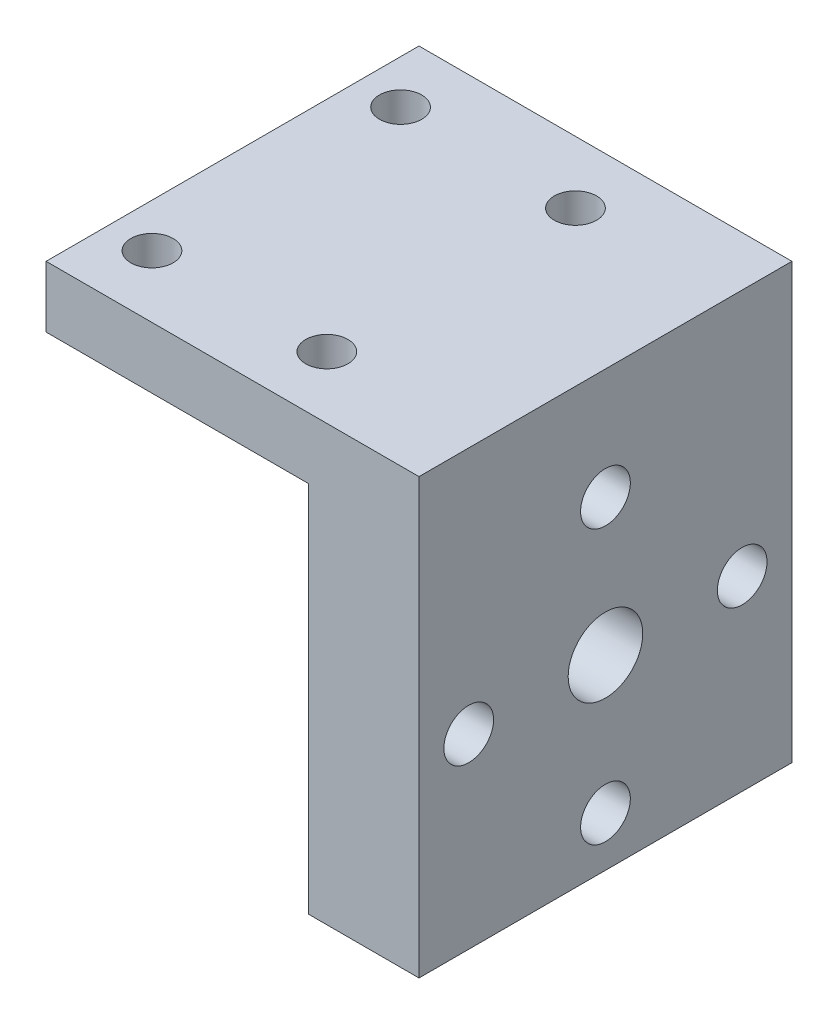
ISO-10303-21;
HEADER;
FILE_DESCRIPTION(('STEP AP214'),'2;1');
FILE_NAME('part.step','',(''),(''),'','','');
FILE_SCHEMA(('AUTOMOTIVE_DESIGN { 1 0 10303 214 1 1 1 1 }'));
ENDSEC;
DATA;
#1=APPLICATION_CONTEXT('core data for automotive mechanical design processes');
#2=APPLICATION_PROTOCOL_DEFINITION('international standard','automotive_design',2000,#1);
#3=PRODUCT_CONTEXT('',#1,'mechanical');
#4=PRODUCT('Part','Part','',(#3));
#5=PRODUCT_RELATED_PRODUCT_CATEGORY('part','',(#4));
#6=PRODUCT_DEFINITION_FORMATION('','',#4);
#7=PRODUCT_DEFINITION_CONTEXT('part definition',#1,'design');
#8=PRODUCT_DEFINITION('design','',#6,#7);
#9=PRODUCT_DEFINITION_SHAPE('','',#8);
#10=(LENGTH_UNIT() NAMED_UNIT(*) SI_UNIT(.MILLI.,.METRE.));
#11=(NAMED_UNIT(*) PLANE_ANGLE_UNIT() SI_UNIT($,.RADIAN.));
#12=(NAMED_UNIT(*) SI_UNIT($,.STERADIAN.) SOLID_ANGLE_UNIT());
#13=UNCERTAINTY_MEASURE_WITH_UNIT(LENGTH_MEASURE(1.E-05),#10,'distance_accuracy_value','');
#14=(GEOMETRIC_REPRESENTATION_CONTEXT(3) GLOBAL_UNCERTAINTY_ASSIGNED_CONTEXT((#13)) GLOBAL_UNIT_ASSIGNED_CONTEXT((#10,
#11,#12)) REPRESENTATION_CONTEXT('',''));
#15=CARTESIAN_POINT('',(0.,0.,0.));
#16=DIRECTION('',(0.,0.,1.));
#17=DIRECTION('',(1.,0.,0.));
#18=AXIS2_PLACEMENT_3D('',#15,#16,#17);
#19=CARTESIAN_POINT('',(0.,0.,30.));
#20=DIRECTION('',(1.,0.,0.));
#21=DIRECTION('',(0.,0.,-1.));
#22=AXIS2_PLACEMENT_3D('',#19,#20,#21);
#23=PLANE('',#22);
#24=CARTESIAN_POINT('',(0.,15.,4.));
#25=DIRECTION('',(-1.,0.,0.));
#26=DIRECTION('',(0.,0.,1.));
#27=AXIS2_PLACEMENT_3D('',#24,#25,#26);
#28=CIRCLE('',#27,2.);
#29=CARTESIAN_POINT('',(0.,15.,6.));
#30=VERTEX_POINT('',#29);
#31=EDGE_CURVE('E196',#30,#30,#28,.T.);
#32=ORIENTED_EDGE('',*,*,#31,.F.);
#33=EDGE_LOOP('',(#32));
#34=FACE_BOUND('',#33,.T.);
#35=CARTESIAN_POINT('',(0.,4.,15.));
#36=DIRECTION('',(-1.,0.,0.));
#37=DIRECTION('',(0.,0.,1.));
#38=AXIS2_PLACEMENT_3D('',#35,#36,#37);
#39=CIRCLE('',#38,2.);
#40=CARTESIAN_POINT('',(0.,4.,17.));
#41=VERTEX_POINT('',#40);
#42=EDGE_CURVE('E200',#41,#41,#39,.T.);
#43=ORIENTED_EDGE('',*,*,#42,.F.);
#44=EDGE_LOOP('',(#43));
#45=FACE_BOUND('',#44,.T.);
#46=CARTESIAN_POINT('',(0.,15.,26.));
#47=DIRECTION('',(-1.,0.,0.));
#48=DIRECTION('',(0.,0.,1.));
#49=AXIS2_PLACEMENT_3D('',#46,#47,#48);
#50=CIRCLE('',#49,2.);
#51=CARTESIAN_POINT('',(0.,15.,28.));
#52=VERTEX_POINT('',#51);
#53=EDGE_CURVE('E204',#52,#52,#50,.T.);
#54=ORIENTED_EDGE('',*,*,#53,.F.);
#55=EDGE_LOOP('',(#54));
#56=FACE_BOUND('',#55,.T.);
#57=CARTESIAN_POINT('',(0.,26.,15.));
#58=DIRECTION('',(-1.,0.,0.));
#59=DIRECTION('',(0.,0.,1.));
#60=AXIS2_PLACEMENT_3D('',#57,#58,#59);
#61=CIRCLE('',#60,2.);
#62=CARTESIAN_POINT('',(0.,26.,17.));
#63=VERTEX_POINT('',#62);
#64=EDGE_CURVE('E208',#63,#63,#61,.T.);
#65=ORIENTED_EDGE('',*,*,#64,.F.);
#66=EDGE_LOOP('',(#65));
#67=FACE_BOUND('',#66,.T.);
#68=CARTESIAN_POINT('',(0.,15.,15.));
#69=DIRECTION('',(-1.,0.,0.));
#70=DIRECTION('',(0.,0.,1.));
#71=AXIS2_PLACEMENT_3D('',#68,#69,#70);
#72=CIRCLE('',#71,8.95);
#73=CARTESIAN_POINT('',(0.,15.,23.95));
#74=VERTEX_POINT('',#73);
#75=EDGE_CURVE('E211',#74,#74,#72,.T.);
#76=ORIENTED_EDGE('',*,*,#75,.F.);
#77=EDGE_LOOP('',(#76));
#78=FACE_BOUND('',#77,.T.);
#79=DIRECTION('',(0.,-1.,0.));
#80=VECTOR('',#79,1.);
#81=CARTESIAN_POINT('',(0.,0.,0.));
#82=LINE('',#81,#80);
#83=CARTESIAN_POINT('',(0.,30.,0.));
#84=VERTEX_POINT('',#83);
#85=CARTESIAN_POINT('',(0.,0.,0.));
#86=VERTEX_POINT('',#85);
#87=EDGE_CURVE('E135',#84,#86,#82,.T.);
#88=ORIENTED_EDGE('',*,*,#87,.T.);
#89=DIRECTION('',(0.,0.,-1.));
#90=VECTOR('',#89,1.);
#91=CARTESIAN_POINT('',(0.,0.,30.));
#92=LINE('',#91,#90);
#93=CARTESIAN_POINT('',(0.,0.,30.));
#94=VERTEX_POINT('',#93);
#95=EDGE_CURVE('E11',#94,#86,#92,.T.);
#96=ORIENTED_EDGE('',*,*,#95,.F.);
#97=DIRECTION('',(0.,-1.,0.));
#98=VECTOR('',#97,1.);
#99=CARTESIAN_POINT('',(0.,0.,30.));
#100=LINE('',#99,#98);
#101=CARTESIAN_POINT('',(0.,30.,30.));
#102=VERTEX_POINT('',#101);
#103=EDGE_CURVE('E153',#102,#94,#100,.T.);
#104=ORIENTED_EDGE('',*,*,#103,.F.);
#105=DIRECTION('',(0.,0.,-1.));
#106=VECTOR('',#105,1.);
#107=CARTESIAN_POINT('',(0.,30.,30.));
#108=LINE('',#107,#106);
#109=EDGE_CURVE('E131',#102,#84,#108,.T.);
#110=ORIENTED_EDGE('',*,*,#109,.T.);
#111=EDGE_LOOP('',(#88,#96,#104,#110));
#112=FACE_BOUND('',#111,.T.);
#113=ADVANCED_FACE('F45',(#34,#45,#56,#67,#78,#112),#23,.F.);
#114=CARTESIAN_POINT('',(0.,0.,30.));
#115=DIRECTION('',(0.,1.,0.));
#116=DIRECTION('',(0.,0.,1.));
#117=AXIS2_PLACEMENT_3D('',#114,#115,#116);
#118=PLANE('',#117);
#119=DIRECTION('',(1.,0.,0.));
#120=VECTOR('',#119,1.);
#121=CARTESIAN_POINT('',(0.,0.,0.));
#122=LINE('',#121,#120);
#123=CARTESIAN_POINT('',(8.89688665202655,0.,0.));
#124=VERTEX_POINT('',#123);
#125=EDGE_CURVE('E139',#86,#124,#122,.T.);
#126=ORIENTED_EDGE('',*,*,#125,.T.);
#127=DIRECTION('',(0.,0.,-1.));
#128=VECTOR('',#127,1.);
#129=CARTESIAN_POINT('',(8.89688665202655,0.,30.));
#130=LINE('',#129,#128);
#131=CARTESIAN_POINT('',(8.89688665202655,0.,30.));
#132=VERTEX_POINT('',#131);
#133=EDGE_CURVE('E55',#132,#124,#130,.T.);
#134=ORIENTED_EDGE('',*,*,#133,.F.);
#135=DIRECTION('',(1.,0.,0.));
#136=VECTOR('',#135,1.);
#137=CARTESIAN_POINT('',(0.,0.,30.));
#138=LINE('',#137,#136);
#139=EDGE_CURVE('E100',#94,#132,#138,.T.);
#140=ORIENTED_EDGE('',*,*,#139,.F.);
#141=ORIENTED_EDGE('',*,*,#95,.T.);
#142=EDGE_LOOP('',(#126,#134,#140,#141));
#143=FACE_BOUND('',#142,.T.);
#144=ADVANCED_FACE('F164',(#143),#118,.F.);
#145=CARTESIAN_POINT('',(8.89688665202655,30.,30.));
#146=DIRECTION('',(-1.,0.,0.));
#147=DIRECTION('',(0.,0.,1.));
#148=AXIS2_PLACEMENT_3D('',#145,#146,#147);
#149=PLANE('',#148);
#150=CARTESIAN_POINT('',(8.89688665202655,15.,4.));
#151=DIRECTION('',(-1.,0.,0.));
#152=DIRECTION('',(0.,0.,1.));
#153=AXIS2_PLACEMENT_3D('',#150,#151,#152);
#154=CIRCLE('',#153,2.);
#155=CARTESIAN_POINT('',(8.89688665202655,15.,6.));
#156=VERTEX_POINT('',#155);
#157=EDGE_CURVE('E220',#156,#156,#154,.T.);
#158=ORIENTED_EDGE('',*,*,#157,.T.);
#159=EDGE_LOOP('',(#158));
#160=FACE_BOUND('',#159,.T.);
#161=CARTESIAN_POINT('',(8.89688665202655,4.,15.));
#162=DIRECTION('',(-1.,0.,0.));
#163=DIRECTION('',(0.,0.,1.));
#164=AXIS2_PLACEMENT_3D('',#161,#162,#163);
#165=CIRCLE('',#164,2.);
#166=CARTESIAN_POINT('',(8.89688665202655,4.,17.));
#167=VERTEX_POINT('',#166);
#168=EDGE_CURVE('E240',#167,#167,#165,.T.);
#169=ORIENTED_EDGE('',*,*,#168,.T.);
#170=EDGE_LOOP('',(#169));
#171=FACE_BOUND('',#170,.T.);
#172=CARTESIAN_POINT('',(8.89688665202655,15.,26.));
#173=DIRECTION('',(-1.,0.,0.));
#174=DIRECTION('',(0.,0.,1.));
#175=AXIS2_PLACEMENT_3D('',#172,#173,#174);
#176=CIRCLE('',#175,2.);
#177=CARTESIAN_POINT('',(8.89688665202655,15.,28.));
#178=VERTEX_POINT('',#177);
#179=EDGE_CURVE('E231',#178,#178,#176,.T.);
#180=ORIENTED_EDGE('',*,*,#179,.T.);
#181=EDGE_LOOP('',(#180));
#182=FACE_BOUND('',#181,.T.);
#183=CARTESIAN_POINT('',(8.89688665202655,15.,15.));
#184=DIRECTION('',(-1.,0.,0.));
#185=DIRECTION('',(0.,0.,1.));
#186=AXIS2_PLACEMENT_3D('',#183,#184,#185);
#187=CIRCLE('',#186,3.);
#188=CARTESIAN_POINT('',(8.89688665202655,15.,18.));
#189=VERTEX_POINT('',#188);
#190=EDGE_CURVE('E227',#189,#189,#187,.T.);
#191=ORIENTED_EDGE('',*,*,#190,.T.);
#192=EDGE_LOOP('',(#191));
#193=FACE_BOUND('',#192,.T.);
#194=CARTESIAN_POINT('',(8.89688665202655,26.,15.));
#195=DIRECTION('',(-1.,0.,0.));
#196=DIRECTION('',(0.,0.,1.));
#197=AXIS2_PLACEMENT_3D('',#194,#195,#196);
#198=CIRCLE('',#197,2.);
#199=CARTESIAN_POINT('',(8.89688665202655,26.,17.));
#200=VERTEX_POINT('',#199);
#201=EDGE_CURVE('E234',#200,#200,#198,.T.);
#202=ORIENTED_EDGE('',*,*,#201,.T.);
#203=EDGE_LOOP('',(#202));
#204=FACE_BOUND('',#203,.T.);
#205=DIRECTION('',(0.,1.,0.));
#206=VECTOR('',#205,1.);
#207=CARTESIAN_POINT('',(8.89688665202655,30.,0.));
#208=LINE('',#207,#206);
#209=CARTESIAN_POINT('',(8.89688665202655,34.9319696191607,0.));
#210=VERTEX_POINT('',#209);
#211=EDGE_CURVE('E144',#124,#210,#208,.T.);
#212=ORIENTED_EDGE('',*,*,#211,.T.);
#213=DIRECTION('',(0.,0.,-1.));
#214=VECTOR('',#213,1.);
#215=CARTESIAN_POINT('',(8.89688665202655,34.9319696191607,30.));
#216=LINE('',#215,#214);
#217=CARTESIAN_POINT('',(8.89688665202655,34.9319696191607,30.));
#218=VERTEX_POINT('',#217);
#219=EDGE_CURVE('E124',#218,#210,#216,.T.);
#220=ORIENTED_EDGE('',*,*,#219,.F.);
#221=DIRECTION('',(0.,1.,0.));
#222=VECTOR('',#221,1.);
#223=CARTESIAN_POINT('',(8.89688665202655,0.,30.));
#224=LINE('',#223,#222);
#225=EDGE_CURVE('E113',#132,#218,#224,.T.);
#226=ORIENTED_EDGE('',*,*,#225,.F.);
#227=ORIENTED_EDGE('',*,*,#133,.T.);
#228=EDGE_LOOP('',(#212,#220,#226,#227));
#229=FACE_BOUND('',#228,.T.);
#230=ADVANCED_FACE('F163',(#160,#171,#182,#193,#204,#229),#149,.F.);
#231=CARTESIAN_POINT('',(8.89688665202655,34.9319696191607,30.));
#232=DIRECTION('',(0.,-1.,0.));
#233=DIRECTION('',(0.,0.,-1.));
#234=AXIS2_PLACEMENT_3D('',#231,#232,#233);
#235=PLANE('',#234);
#236=CARTESIAN_POINT('',(-17.5859277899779,34.9319696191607,5.));
#237=DIRECTION('',(0.,-1.,0.));
#238=DIRECTION('',(0.,0.,-1.));
#239=AXIS2_PLACEMENT_3D('',#236,#237,#238);
#240=CIRCLE('',#239,1.7);
#241=CARTESIAN_POINT('',(-17.5859277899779,34.9319696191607,3.3));
#242=VERTEX_POINT('',#241);
#243=EDGE_CURVE('E263',#242,#242,#240,.T.);
#244=ORIENTED_EDGE('',*,*,#243,.T.);
#245=EDGE_LOOP('',(#244));
#246=FACE_BOUND('',#245,.T.);
#247=CARTESIAN_POINT('',(-3.51718555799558,34.9319696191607,5.));
#248=DIRECTION('',(0.,-1.,0.));
#249=DIRECTION('',(0.,0.,-1.));
#250=AXIS2_PLACEMENT_3D('',#247,#248,#249);
#251=CIRCLE('',#250,1.7);
#252=CARTESIAN_POINT('',(-3.51718555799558,34.9319696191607,3.3));
#253=VERTEX_POINT('',#252);
#254=EDGE_CURVE('E271',#253,#253,#251,.T.);
#255=ORIENTED_EDGE('',*,*,#254,.T.);
#256=EDGE_LOOP('',(#255));
#257=FACE_BOUND('',#256,.T.);
#258=CARTESIAN_POINT('',(-3.51718555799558,34.9319696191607,25.));
#259=DIRECTION('',(0.,-1.,0.));
#260=DIRECTION('',(0.,0.,-1.));
#261=AXIS2_PLACEMENT_3D('',#258,#259,#260);
#262=CIRCLE('',#261,1.7);
#263=CARTESIAN_POINT('',(-3.51718555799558,34.9319696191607,23.3));
#264=VERTEX_POINT('',#263);
#265=EDGE_CURVE('E279',#264,#264,#262,.T.);
#266=ORIENTED_EDGE('',*,*,#265,.T.);
#267=EDGE_LOOP('',(#266));
#268=FACE_BOUND('',#267,.T.);
#269=CARTESIAN_POINT('',(-17.5859277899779,34.9319696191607,25.));
#270=DIRECTION('',(0.,-1.,0.));
#271=DIRECTION('',(0.,0.,-1.));
#272=AXIS2_PLACEMENT_3D('',#269,#270,#271);
#273=CIRCLE('',#272,1.7);
#274=CARTESIAN_POINT('',(-17.5859277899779,34.9319696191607,23.3));
#275=VERTEX_POINT('',#274);
#276=EDGE_CURVE('E241',#275,#275,#273,.T.);
#277=ORIENTED_EDGE('',*,*,#276,.T.);
#278=EDGE_LOOP('',(#277));
#279=FACE_BOUND('',#278,.T.);
#280=DIRECTION('',(-1.,0.,0.));
#281=VECTOR('',#280,1.);
#282=CARTESIAN_POINT('',(8.89688665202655,34.9319696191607,0.));
#283=LINE('',#282,#281);
#284=CARTESIAN_POINT('',(-21.1031133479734,34.9319696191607,0.));
#285=VERTEX_POINT('',#284);
#286=EDGE_CURVE('E122',#210,#285,#283,.T.);
#287=ORIENTED_EDGE('',*,*,#286,.T.);
#288=DIRECTION('',(0.,0.,-1.));
#289=VECTOR('',#288,1.);
#290=CARTESIAN_POINT('',(-21.1031133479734,34.9319696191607,30.));
#291=LINE('',#290,#289);
#292=CARTESIAN_POINT('',(-21.1031133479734,34.9319696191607,30.));
#293=VERTEX_POINT('',#292);
#294=EDGE_CURVE('E119',#293,#285,#291,.T.);
#295=ORIENTED_EDGE('',*,*,#294,.F.);
#296=DIRECTION('',(-1.,0.,0.));
#297=VECTOR('',#296,1.);
#298=CARTESIAN_POINT('',(8.89688665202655,34.9319696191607,30.));
#299=LINE('',#298,#297);
#300=EDGE_CURVE('E107',#218,#293,#299,.T.);
#301=ORIENTED_EDGE('',*,*,#300,.F.);
#302=ORIENTED_EDGE('',*,*,#219,.T.);
#303=EDGE_LOOP('',(#287,#295,#301,#302));
#304=FACE_BOUND('',#303,.T.);
#305=ADVANCED_FACE('F120',(#246,#257,#268,#279,#304),#235,.F.);
#306=CARTESIAN_POINT('',(-21.1031133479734,30.,30.));
#307=DIRECTION('',(1.,0.,0.));
#308=DIRECTION('',(0.,0.,-1.));
#309=AXIS2_PLACEMENT_3D('',#306,#307,#308);
#310=PLANE('',#309);
#311=DIRECTION('',(0.,-1.,0.));
#312=VECTOR('',#311,1.);
#313=CARTESIAN_POINT('',(-21.1031133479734,30.,0.));
#314=LINE('',#313,#312);
#315=CARTESIAN_POINT('',(-21.1031133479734,30.,0.));
#316=VERTEX_POINT('',#315);
#317=EDGE_CURVE('E86',#285,#316,#314,.T.);
#318=ORIENTED_EDGE('',*,*,#317,.T.);
#319=DIRECTION('',(0.,0.,-1.));
#320=VECTOR('',#319,1.);
#321=CARTESIAN_POINT('',(-21.1031133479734,30.,30.));
#322=LINE('',#321,#320);
#323=CARTESIAN_POINT('',(-21.1031133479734,30.,30.));
#324=VERTEX_POINT('',#323);
#325=EDGE_CURVE('E125',#324,#316,#322,.T.);
#326=ORIENTED_EDGE('',*,*,#325,.F.);
#327=DIRECTION('',(0.,-1.,0.));
#328=VECTOR('',#327,1.);
#329=CARTESIAN_POINT('',(-21.1031133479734,30.,30.));
#330=LINE('',#329,#328);
#331=EDGE_CURVE('E111',#293,#324,#330,.T.);
#332=ORIENTED_EDGE('',*,*,#331,.F.);
#333=ORIENTED_EDGE('',*,*,#294,.T.);
#334=EDGE_LOOP('',(#318,#326,#332,#333));
#335=FACE_BOUND('',#334,.T.);
#336=ADVANCED_FACE('F127',(#335),#310,.F.);
#337=CARTESIAN_POINT('',(0.,30.,30.));
#338=DIRECTION('',(0.,1.,0.));
#339=DIRECTION('',(0.,0.,1.));
#340=AXIS2_PLACEMENT_3D('',#337,#338,#339);
#341=PLANE('',#340);
#342=CARTESIAN_POINT('',(-17.5859277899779,30.,5.));
#343=DIRECTION('',(0.,-1.,0.));
#344=DIRECTION('',(0.,0.,-1.));
#345=AXIS2_PLACEMENT_3D('',#342,#343,#344);
#346=CIRCLE('',#345,1.7);
#347=CARTESIAN_POINT('',(-17.5859277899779,30.,3.3));
#348=VERTEX_POINT('',#347);
#349=EDGE_CURVE('E267',#348,#348,#346,.T.);
#350=ORIENTED_EDGE('',*,*,#349,.F.);
#351=EDGE_LOOP('',(#350));
#352=FACE_BOUND('',#351,.T.);
#353=CARTESIAN_POINT('',(-3.51718555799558,30.,5.));
#354=DIRECTION('',(0.,-1.,0.));
#355=DIRECTION('',(0.,0.,-1.));
#356=AXIS2_PLACEMENT_3D('',#353,#354,#355);
#357=CIRCLE('',#356,1.7);
#358=CARTESIAN_POINT('',(-3.51718555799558,30.,3.3));
#359=VERTEX_POINT('',#358);
#360=EDGE_CURVE('E275',#359,#359,#357,.T.);
#361=ORIENTED_EDGE('',*,*,#360,.F.);
#362=EDGE_LOOP('',(#361));
#363=FACE_BOUND('',#362,.T.);
#364=CARTESIAN_POINT('',(-3.51718555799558,30.,25.));
#365=DIRECTION('',(0.,-1.,0.));
#366=DIRECTION('',(0.,0.,-1.));
#367=AXIS2_PLACEMENT_3D('',#364,#365,#366);
#368=CIRCLE('',#367,1.7);
#369=CARTESIAN_POINT('',(-3.51718555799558,30.,23.3));
#370=VERTEX_POINT('',#369);
#371=EDGE_CURVE('E259',#370,#370,#368,.T.);
#372=ORIENTED_EDGE('',*,*,#371,.F.);
#373=EDGE_LOOP('',(#372));
#374=FACE_BOUND('',#373,.T.);
#375=CARTESIAN_POINT('',(-17.5859277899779,30.,25.));
#376=DIRECTION('',(0.,-1.,0.));
#377=DIRECTION('',(0.,0.,-1.));
#378=AXIS2_PLACEMENT_3D('',#375,#376,#377);
#379=CIRCLE('',#378,1.7);
#380=CARTESIAN_POINT('',(-17.5859277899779,30.,23.3));
#381=VERTEX_POINT('',#380);
#382=EDGE_CURVE('E255',#381,#381,#379,.T.);
#383=ORIENTED_EDGE('',*,*,#382,.F.);
#384=EDGE_LOOP('',(#383));
#385=FACE_BOUND('',#384,.T.);
#386=DIRECTION('',(1.,0.,0.));
#387=VECTOR('',#386,1.);
#388=CARTESIAN_POINT('',(0.,30.,0.));
#389=LINE('',#388,#387);
#390=EDGE_CURVE('E92',#316,#84,#389,.T.);
#391=ORIENTED_EDGE('',*,*,#390,.T.);
#392=ORIENTED_EDGE('',*,*,#109,.F.);
#393=DIRECTION('',(1.,0.,0.));
#394=VECTOR('',#393,1.);
#395=CARTESIAN_POINT('',(0.,30.,30.));
#396=LINE('',#395,#394);
#397=EDGE_CURVE('E63',#324,#102,#396,.T.);
#398=ORIENTED_EDGE('',*,*,#397,.F.);
#399=ORIENTED_EDGE('',*,*,#325,.T.);
#400=EDGE_LOOP('',(#391,#392,#398,#399));
#401=FACE_BOUND('',#400,.T.);
#402=ADVANCED_FACE('F171',(#352,#363,#374,#385,#401),#341,.F.);
#403=CARTESIAN_POINT('',(0.,0.,30.));
#404=DIRECTION('',(0.,0.,1.));
#405=DIRECTION('',(1.,0.,0.));
#406=AXIS2_PLACEMENT_3D('',#403,#404,#405);
#407=PLANE('',#406);
#408=ORIENTED_EDGE('',*,*,#103,.T.);
#409=ORIENTED_EDGE('',*,*,#139,.T.);
#410=ORIENTED_EDGE('',*,*,#225,.T.);
#411=ORIENTED_EDGE('',*,*,#300,.T.);
#412=ORIENTED_EDGE('',*,*,#331,.T.);
#413=ORIENTED_EDGE('',*,*,#397,.T.);
#414=EDGE_LOOP('',(#408,#409,#410,#411,#412,#413));
#415=FACE_BOUND('',#414,.T.);
#416=ADVANCED_FACE('F109',(#415),#407,.T.);
#417=CARTESIAN_POINT('',(0.,0.,0.));
#418=DIRECTION('',(0.,0.,1.));
#419=DIRECTION('',(1.,0.,0.));
#420=AXIS2_PLACEMENT_3D('',#417,#418,#419);
#421=PLANE('',#420);
#422=ORIENTED_EDGE('',*,*,#87,.F.);
#423=ORIENTED_EDGE('',*,*,#390,.F.);
#424=ORIENTED_EDGE('',*,*,#317,.F.);
#425=ORIENTED_EDGE('',*,*,#286,.F.);
#426=ORIENTED_EDGE('',*,*,#211,.F.);
#427=ORIENTED_EDGE('',*,*,#125,.F.);
#428=EDGE_LOOP('',(#422,#423,#424,#425,#426,#427));
#429=FACE_BOUND('',#428,.T.);
#430=ADVANCED_FACE('F168',(#429),#421,.F.);
#431=CARTESIAN_POINT('',(2.,15.,15.));
#432=DIRECTION('',(-1.,0.,0.));
#433=DIRECTION('',(0.,0.,1.));
#434=AXIS2_PLACEMENT_3D('',#431,#432,#433);
#435=CYLINDRICAL_SURFACE('',#434,8.95);
#436=CARTESIAN_POINT('',(2.,15.,15.));
#437=DIRECTION('',(-1.,0.,0.));
#438=DIRECTION('',(0.,0.,1.));
#439=AXIS2_PLACEMENT_3D('',#436,#437,#438);
#440=CIRCLE('',#439,8.95);
#441=CARTESIAN_POINT('',(2.,15.,23.95));
#442=VERTEX_POINT('',#441);
#443=EDGE_CURVE('E140',#442,#442,#440,.T.);
#444=ORIENTED_EDGE('',*,*,#443,.F.);
#445=EDGE_LOOP('',(#444));
#446=FACE_BOUND('',#445,.T.);
#447=ORIENTED_EDGE('',*,*,#75,.T.);
#448=EDGE_LOOP('',(#447));
#449=FACE_BOUND('',#448,.T.);
#450=ADVANCED_FACE('F329',(#446,#449),#435,.F.);
#451=CARTESIAN_POINT('',(2.,15.,15.));
#452=DIRECTION('',(-1.,0.,0.));
#453=DIRECTION('',(0.,0.,1.));
#454=AXIS2_PLACEMENT_3D('',#451,#452,#453);
#455=PLANE('',#454);
#456=CARTESIAN_POINT('',(2.,15.,15.));
#457=DIRECTION('',(-1.,0.,0.));
#458=DIRECTION('',(0.,0.,1.));
#459=AXIS2_PLACEMENT_3D('',#456,#457,#458);
#460=CIRCLE('',#459,3.);
#461=CARTESIAN_POINT('',(2.,15.,18.));
#462=VERTEX_POINT('',#461);
#463=EDGE_CURVE('E48',#462,#462,#460,.T.);
#464=ORIENTED_EDGE('',*,*,#463,.F.);
#465=EDGE_LOOP('',(#464));
#466=FACE_BOUND('',#465,.T.);
#467=ORIENTED_EDGE('',*,*,#443,.T.);
#468=EDGE_LOOP('',(#467));
#469=FACE_BOUND('',#468,.T.);
#470=ADVANCED_FACE('F325',(#466,#469),#455,.T.);
#471=CARTESIAN_POINT('',(8.89688665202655,15.,15.));
#472=DIRECTION('',(-1.,0.,0.));
#473=DIRECTION('',(0.,0.,1.));
#474=AXIS2_PLACEMENT_3D('',#471,#472,#473);
#475=CYLINDRICAL_SURFACE('',#474,3.);
#476=ORIENTED_EDGE('',*,*,#463,.T.);
#477=EDGE_LOOP('',(#476));
#478=FACE_BOUND('',#477,.T.);
#479=ORIENTED_EDGE('',*,*,#190,.F.);
#480=EDGE_LOOP('',(#479));
#481=FACE_BOUND('',#480,.T.);
#482=ADVANCED_FACE('F321',(#478,#481),#475,.F.);
#483=CARTESIAN_POINT('',(8.89688665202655,26.,15.));
#484=DIRECTION('',(-1.,0.,0.));
#485=DIRECTION('',(0.,0.,1.));
#486=AXIS2_PLACEMENT_3D('',#483,#484,#485);
#487=CYLINDRICAL_SURFACE('',#486,2.);
#488=ORIENTED_EDGE('',*,*,#201,.F.);
#489=EDGE_LOOP('',(#488));
#490=FACE_BOUND('',#489,.T.);
#491=ORIENTED_EDGE('',*,*,#64,.T.);
#492=EDGE_LOOP('',(#491));
#493=FACE_BOUND('',#492,.T.);
#494=ADVANCED_FACE('F314',(#490,#493),#487,.F.);
#495=CARTESIAN_POINT('',(8.89688665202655,15.,26.));
#496=DIRECTION('',(-1.,0.,0.));
#497=DIRECTION('',(0.,0.,1.));
#498=AXIS2_PLACEMENT_3D('',#495,#496,#497);
#499=CYLINDRICAL_SURFACE('',#498,2.);
#500=ORIENTED_EDGE('',*,*,#179,.F.);
#501=EDGE_LOOP('',(#500));
#502=FACE_BOUND('',#501,.T.);
#503=ORIENTED_EDGE('',*,*,#53,.T.);
#504=EDGE_LOOP('',(#503));
#505=FACE_BOUND('',#504,.T.);
#506=ADVANCED_FACE('F311',(#502,#505),#499,.F.);
#507=CARTESIAN_POINT('',(8.89688665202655,4.,15.));
#508=DIRECTION('',(-1.,0.,0.));
#509=DIRECTION('',(0.,0.,1.));
#510=AXIS2_PLACEMENT_3D('',#507,#508,#509);
#511=CYLINDRICAL_SURFACE('',#510,2.);
#512=ORIENTED_EDGE('',*,*,#168,.F.);
#513=EDGE_LOOP('',(#512));
#514=FACE_BOUND('',#513,.T.);
#515=ORIENTED_EDGE('',*,*,#42,.T.);
#516=EDGE_LOOP('',(#515));
#517=FACE_BOUND('',#516,.T.);
#518=ADVANCED_FACE('F303',(#514,#517),#511,.F.);
#519=CARTESIAN_POINT('',(8.89688665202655,15.,4.));
#520=DIRECTION('',(-1.,0.,0.));
#521=DIRECTION('',(0.,0.,1.));
#522=AXIS2_PLACEMENT_3D('',#519,#520,#521);
#523=CYLINDRICAL_SURFACE('',#522,2.);
#524=ORIENTED_EDGE('',*,*,#157,.F.);
#525=EDGE_LOOP('',(#524));
#526=FACE_BOUND('',#525,.T.);
#527=ORIENTED_EDGE('',*,*,#31,.T.);
#528=EDGE_LOOP('',(#527));
#529=FACE_BOUND('',#528,.T.);
#530=ADVANCED_FACE('F293',(#526,#529),#523,.F.);
#531=CARTESIAN_POINT('',(-17.5859277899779,34.9319696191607,25.));
#532=DIRECTION('',(0.,-1.,0.));
#533=DIRECTION('',(0.,0.,-1.));
#534=AXIS2_PLACEMENT_3D('',#531,#532,#533);
#535=CYLINDRICAL_SURFACE('',#534,1.7);
#536=CARTESIAN_POINT('',(-17.5859277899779,34.9319696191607,23.3));
#537=CARTESIAN_POINT('',(-17.5859277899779,34.8805949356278,23.3));
#538=CARTESIAN_POINT('',(-17.5859277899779,34.8292202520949,23.3));
#539=CARTESIAN_POINT('',(-17.5859277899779,34.726470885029,23.3));
#540=CARTESIAN_POINT('',(-17.5859277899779,34.6750962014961,23.3));
#541=CARTESIAN_POINT('',(-17.5859277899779,34.5723468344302,23.3));
#542=CARTESIAN_POINT('',(-17.5859277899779,34.5209721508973,23.3));
#543=CARTESIAN_POINT('',(-17.5859277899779,34.4182227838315,23.3));
#544=CARTESIAN_POINT('',(-17.5859277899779,34.3668481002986,23.3));
#545=CARTESIAN_POINT('',(-17.5859277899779,34.2640987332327,23.3));
#546=CARTESIAN_POINT('',(-17.5859277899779,34.2127240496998,23.3));
#547=CARTESIAN_POINT('',(-17.5859277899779,34.1099746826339,23.3));
#548=CARTESIAN_POINT('',(-17.5859277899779,34.058599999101,23.3));
#549=CARTESIAN_POINT('',(-17.5859277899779,33.9558506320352,23.3));
#550=CARTESIAN_POINT('',(-17.5859277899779,33.9044759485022,23.3));
#551=CARTESIAN_POINT('',(-17.5859277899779,33.8017265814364,23.3));
#552=CARTESIAN_POINT('',(-17.5859277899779,33.7503518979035,23.3));
#553=CARTESIAN_POINT('',(-17.5859277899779,33.6476025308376,23.3));
#554=CARTESIAN_POINT('',(-17.5859277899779,33.5962278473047,23.3));
#555=CARTESIAN_POINT('',(-17.5859277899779,33.4934784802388,23.3));
#556=CARTESIAN_POINT('',(-17.5859277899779,33.4421037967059,23.3));
#557=CARTESIAN_POINT('',(-17.5859277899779,33.3393544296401,23.3));
#558=CARTESIAN_POINT('',(-17.5859277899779,33.2879797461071,23.3));
#559=CARTESIAN_POINT('',(-17.5859277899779,33.1852303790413,23.3));
#560=CARTESIAN_POINT('',(-17.5859277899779,33.1338556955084,23.3));
#561=CARTESIAN_POINT('',(-17.5859277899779,33.0311063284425,23.3));
#562=CARTESIAN_POINT('',(-17.5859277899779,32.9797316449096,23.3));
#563=CARTESIAN_POINT('',(-17.5859277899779,32.8769822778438,23.3));
#564=CARTESIAN_POINT('',(-17.5859277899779,32.8256075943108,23.3));
#565=CARTESIAN_POINT('',(-17.5859277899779,32.722858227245,23.3));
#566=CARTESIAN_POINT('',(-17.5859277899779,32.6714835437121,23.3));
#567=CARTESIAN_POINT('',(-17.5859277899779,32.5687341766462,23.3));
#568=CARTESIAN_POINT('',(-17.5859277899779,32.5173594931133,23.3));
#569=CARTESIAN_POINT('',(-17.5859277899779,32.4146101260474,23.3));
#570=CARTESIAN_POINT('',(-17.5859277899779,32.3632354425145,23.3));
#571=CARTESIAN_POINT('',(-17.5859277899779,32.2604860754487,23.3));
#572=CARTESIAN_POINT('',(-17.5859277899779,32.2091113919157,23.3));
#573=CARTESIAN_POINT('',(-17.5859277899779,32.1063620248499,23.3));
#574=CARTESIAN_POINT('',(-17.5859277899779,32.054987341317,23.3));
#575=CARTESIAN_POINT('',(-17.5859277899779,31.9522379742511,23.3));
#576=CARTESIAN_POINT('',(-17.5859277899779,31.9008632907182,23.3));
#577=CARTESIAN_POINT('',(-17.5859277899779,31.7981139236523,23.3));
#578=CARTESIAN_POINT('',(-17.5859277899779,31.7467392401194,23.3));
#579=CARTESIAN_POINT('',(-17.5859277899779,31.6439898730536,23.3));
#580=CARTESIAN_POINT('',(-17.5859277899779,31.5926151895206,23.3));
#581=CARTESIAN_POINT('',(-17.5859277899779,31.4898658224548,23.3));
#582=CARTESIAN_POINT('',(-17.5859277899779,31.4384911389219,23.3));
#583=CARTESIAN_POINT('',(-17.5859277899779,31.335741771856,23.3));
#584=CARTESIAN_POINT('',(-17.5859277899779,31.2843670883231,23.3));
#585=CARTESIAN_POINT('',(-17.5859277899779,31.1816177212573,23.3));
#586=CARTESIAN_POINT('',(-17.5859277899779,31.1302430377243,23.3));
#587=CARTESIAN_POINT('',(-17.5859277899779,31.0274936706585,23.3));
#588=CARTESIAN_POINT('',(-17.5859277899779,30.9761189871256,23.3));
#589=CARTESIAN_POINT('',(-17.5859277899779,30.8733696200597,23.3));
#590=CARTESIAN_POINT('',(-17.5859277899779,30.8219949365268,23.3));
#591=CARTESIAN_POINT('',(-17.5859277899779,30.7192455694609,23.3));
#592=CARTESIAN_POINT('',(-17.5859277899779,30.667870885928,23.3));
#593=CARTESIAN_POINT('',(-17.5859277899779,30.5651215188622,23.3));
#594=CARTESIAN_POINT('',(-17.5859277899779,30.5137468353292,23.3));
#595=CARTESIAN_POINT('',(-17.5859277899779,30.4109974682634,23.3));
#596=CARTESIAN_POINT('',(-17.5859277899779,30.3596227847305,23.3));
#597=CARTESIAN_POINT('',(-17.5859277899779,30.2568734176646,23.3));
#598=CARTESIAN_POINT('',(-17.5859277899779,30.2054987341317,23.3));
#599=CARTESIAN_POINT('',(-17.5859277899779,30.1027493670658,23.3));
#600=CARTESIAN_POINT('',(-17.5859277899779,30.0513746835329,23.3));
#601=CARTESIAN_POINT('',(-17.5859277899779,30.,23.3));
#602=B_SPLINE_CURVE_WITH_KNOTS('',3,(#536,#537,#538,#539,#540,#541,#542,#543,#544,#545,#546,
#547,#548,#549,#550,#551,#552,#553,#554,#555,#556,#557,#558,#559,#560,#561,#562,#563,#564,#565,
#566,#567,#568,#569,#570,#571,#572,#573,#574,#575,#576,#577,#578,#579,#580,#581,#582,#583,#584,
#585,#586,#587,#588,#589,#590,#591,#592,#593,#594,#595,#596,#597,#598,#599,#600,#601),
.UNSPECIFIED.,.F.,.F.,(4,2,2,2,2,2,2,2,2,2,2,2,2,2,2,2,2,2,2,2,2,2,2,2,2,2,2,2,2,2,2,2,4),(0.,
0.154124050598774,0.308248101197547,0.462372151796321,0.616496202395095,0.770620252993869,
0.924744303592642,1.07886835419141,1.23299240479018,1.38711645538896,1.54124050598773,
1.6953645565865,1.84948860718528,2.00361265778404,2.15773670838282,2.31186075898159,
2.46598480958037,2.62010886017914,2.77423291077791,2.92835696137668,3.08248101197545,
3.23660506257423,3.390729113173,3.54485316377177,3.69897721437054,3.85310126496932,
4.00722531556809,4.16134936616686,4.31547341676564,4.46959746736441,4.62372151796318,
4.77784556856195,4.93196961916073),.UNSPECIFIED.);
#603=EDGE_CURVE('BSEAM292',#275,#381,#602,.T.);
#604=ORIENTED_EDGE('',*,*,#276,.F.);
#605=ORIENTED_EDGE('',*,*,#382,.T.);
#606=ORIENTED_EDGE('',*,*,#603,.T.);
#607=ORIENTED_EDGE('',*,*,#603,.F.);
#608=EDGE_LOOP('',(#604,#606,#605,#607));
#609=FACE_BOUND('',#608,.T.);
#610=ADVANCED_FACE('F292',(#609),#535,.F.);
#611=CARTESIAN_POINT('',(-3.51718555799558,34.9319696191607,25.));
#612=DIRECTION('',(0.,-1.,0.));
#613=DIRECTION('',(0.,0.,-1.));
#614=AXIS2_PLACEMENT_3D('',#611,#612,#613);
#615=CYLINDRICAL_SURFACE('',#614,1.7);
#616=CARTESIAN_POINT('',(-3.51718555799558,34.9319696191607,23.3));
#617=CARTESIAN_POINT('',(-3.51718555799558,34.8805949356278,23.3));
#618=CARTESIAN_POINT('',(-3.51718555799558,34.8292202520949,23.3));
#619=CARTESIAN_POINT('',(-3.51718555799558,34.726470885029,23.3));
#620=CARTESIAN_POINT('',(-3.51718555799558,34.6750962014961,23.3));
#621=CARTESIAN_POINT('',(-3.51718555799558,34.5723468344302,23.3));
#622=CARTESIAN_POINT('',(-3.51718555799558,34.5209721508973,23.3));
#623=CARTESIAN_POINT('',(-3.51718555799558,34.4182227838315,23.3));
#624=CARTESIAN_POINT('',(-3.51718555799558,34.3668481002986,23.3));
#625=CARTESIAN_POINT('',(-3.51718555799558,34.2640987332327,23.3));
#626=CARTESIAN_POINT('',(-3.51718555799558,34.2127240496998,23.3));
#627=CARTESIAN_POINT('',(-3.51718555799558,34.1099746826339,23.3));
#628=CARTESIAN_POINT('',(-3.51718555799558,34.058599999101,23.3));
#629=CARTESIAN_POINT('',(-3.51718555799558,33.9558506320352,23.3));
#630=CARTESIAN_POINT('',(-3.51718555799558,33.9044759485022,23.3));
#631=CARTESIAN_POINT('',(-3.51718555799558,33.8017265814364,23.3));
#632=CARTESIAN_POINT('',(-3.51718555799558,33.7503518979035,23.3));
#633=CARTESIAN_POINT('',(-3.51718555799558,33.6476025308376,23.3));
#634=CARTESIAN_POINT('',(-3.51718555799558,33.5962278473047,23.3));
#635=CARTESIAN_POINT('',(-3.51718555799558,33.4934784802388,23.3));
#636=CARTESIAN_POINT('',(-3.51718555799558,33.4421037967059,23.3));
#637=CARTESIAN_POINT('',(-3.51718555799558,33.3393544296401,23.3));
#638=CARTESIAN_POINT('',(-3.51718555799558,33.2879797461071,23.3));
#639=CARTESIAN_POINT('',(-3.51718555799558,33.1852303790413,23.3));
#640=CARTESIAN_POINT('',(-3.51718555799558,33.1338556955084,23.3));
#641=CARTESIAN_POINT('',(-3.51718555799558,33.0311063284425,23.3));
#642=CARTESIAN_POINT('',(-3.51718555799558,32.9797316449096,23.3));
#643=CARTESIAN_POINT('',(-3.51718555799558,32.8769822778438,23.3));
#644=CARTESIAN_POINT('',(-3.51718555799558,32.8256075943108,23.3));
#645=CARTESIAN_POINT('',(-3.51718555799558,32.722858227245,23.3));
#646=CARTESIAN_POINT('',(-3.51718555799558,32.6714835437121,23.3));
#647=CARTESIAN_POINT('',(-3.51718555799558,32.5687341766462,23.3));
#648=CARTESIAN_POINT('',(-3.51718555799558,32.5173594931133,23.3));
#649=CARTESIAN_POINT('',(-3.51718555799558,32.4146101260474,23.3));
#650=CARTESIAN_POINT('',(-3.51718555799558,32.3632354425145,23.3));
#651=CARTESIAN_POINT('',(-3.51718555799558,32.2604860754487,23.3));
#652=CARTESIAN_POINT('',(-3.51718555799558,32.2091113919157,23.3));
#653=CARTESIAN_POINT('',(-3.51718555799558,32.1063620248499,23.3));
#654=CARTESIAN_POINT('',(-3.51718555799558,32.054987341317,23.3));
#655=CARTESIAN_POINT('',(-3.51718555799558,31.9522379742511,23.3));
#656=CARTESIAN_POINT('',(-3.51718555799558,31.9008632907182,23.3));
#657=CARTESIAN_POINT('',(-3.51718555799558,31.7981139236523,23.3));
#658=CARTESIAN_POINT('',(-3.51718555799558,31.7467392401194,23.3));
#659=CARTESIAN_POINT('',(-3.51718555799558,31.6439898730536,23.3));
#660=CARTESIAN_POINT('',(-3.51718555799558,31.5926151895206,23.3));
#661=CARTESIAN_POINT('',(-3.51718555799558,31.4898658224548,23.3));
#662=CARTESIAN_POINT('',(-3.51718555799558,31.4384911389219,23.3));
#663=CARTESIAN_POINT('',(-3.51718555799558,31.335741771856,23.3));
#664=CARTESIAN_POINT('',(-3.51718555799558,31.2843670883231,23.3));
#665=CARTESIAN_POINT('',(-3.51718555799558,31.1816177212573,23.3));
#666=CARTESIAN_POINT('',(-3.51718555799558,31.1302430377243,23.3));
#667=CARTESIAN_POINT('',(-3.51718555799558,31.0274936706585,23.3));
#668=CARTESIAN_POINT('',(-3.51718555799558,30.9761189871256,23.3));
#669=CARTESIAN_POINT('',(-3.51718555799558,30.8733696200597,23.3));
#670=CARTESIAN_POINT('',(-3.51718555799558,30.8219949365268,23.3));
#671=CARTESIAN_POINT('',(-3.51718555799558,30.7192455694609,23.3));
#672=CARTESIAN_POINT('',(-3.51718555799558,30.667870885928,23.3));
#673=CARTESIAN_POINT('',(-3.51718555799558,30.5651215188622,23.3));
#674=CARTESIAN_POINT('',(-3.51718555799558,30.5137468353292,23.3));
#675=CARTESIAN_POINT('',(-3.51718555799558,30.4109974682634,23.3));
#676=CARTESIAN_POINT('',(-3.51718555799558,30.3596227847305,23.3));
#677=CARTESIAN_POINT('',(-3.51718555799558,30.2568734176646,23.3));
#678=CARTESIAN_POINT('',(-3.51718555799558,30.2054987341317,23.3));
#679=CARTESIAN_POINT('',(-3.51718555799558,30.1027493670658,23.3));
#680=CARTESIAN_POINT('',(-3.51718555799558,30.0513746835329,23.3));
#681=CARTESIAN_POINT('',(-3.51718555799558,30.,23.3));
#682=B_SPLINE_CURVE_WITH_KNOTS('',3,(#616,#617,#618,#619,#620,#621,#622,#623,#624,#625,#626,
#627,#628,#629,#630,#631,#632,#633,#634,#635,#636,#637,#638,#639,#640,#641,#642,#643,#644,#645,
#646,#647,#648,#649,#650,#651,#652,#653,#654,#655,#656,#657,#658,#659,#660,#661,#662,#663,#664,
#665,#666,#667,#668,#669,#670,#671,#672,#673,#674,#675,#676,#677,#678,#679,#680,#681),
.UNSPECIFIED.,.F.,.F.,(4,2,2,2,2,2,2,2,2,2,2,2,2,2,2,2,2,2,2,2,2,2,2,2,2,2,2,2,2,2,2,2,4),(0.,
0.154124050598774,0.308248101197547,0.462372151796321,0.616496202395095,0.770620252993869,
0.924744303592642,1.07886835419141,1.23299240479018,1.38711645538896,1.54124050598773,
1.6953645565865,1.84948860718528,2.00361265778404,2.15773670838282,2.31186075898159,
2.46598480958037,2.62010886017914,2.77423291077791,2.92835696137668,3.08248101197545,
3.23660506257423,3.390729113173,3.54485316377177,3.69897721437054,3.85310126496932,
4.00722531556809,4.16134936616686,4.31547341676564,4.46959746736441,4.62372151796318,
4.77784556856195,4.93196961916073),.UNSPECIFIED.);
#683=EDGE_CURVE('BSEAM287',#264,#370,#682,.T.);
#684=ORIENTED_EDGE('',*,*,#265,.F.);
#685=ORIENTED_EDGE('',*,*,#371,.T.);
#686=ORIENTED_EDGE('',*,*,#683,.T.);
#687=ORIENTED_EDGE('',*,*,#683,.F.);
#688=EDGE_LOOP('',(#684,#686,#685,#687));
#689=FACE_BOUND('',#688,.T.);
#690=ADVANCED_FACE('F287',(#689),#615,.F.);
#691=CARTESIAN_POINT('',(-3.51718555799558,34.9319696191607,5.));
#692=DIRECTION('',(0.,-1.,0.));
#693=DIRECTION('',(0.,0.,-1.));
#694=AXIS2_PLACEMENT_3D('',#691,#692,#693);
#695=CYLINDRICAL_SURFACE('',#694,1.7);
#696=CARTESIAN_POINT('',(-3.51718555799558,34.9319696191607,3.3));
#697=CARTESIAN_POINT('',(-3.51718555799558,34.8805949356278,3.3));
#698=CARTESIAN_POINT('',(-3.51718555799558,34.8292202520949,3.3));
#699=CARTESIAN_POINT('',(-3.51718555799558,34.726470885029,3.3));
#700=CARTESIAN_POINT('',(-3.51718555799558,34.6750962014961,3.3));
#701=CARTESIAN_POINT('',(-3.51718555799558,34.5723468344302,3.3));
#702=CARTESIAN_POINT('',(-3.51718555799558,34.5209721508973,3.3));
#703=CARTESIAN_POINT('',(-3.51718555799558,34.4182227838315,3.3));
#704=CARTESIAN_POINT('',(-3.51718555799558,34.3668481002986,3.3));
#705=CARTESIAN_POINT('',(-3.51718555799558,34.2640987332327,3.3));
#706=CARTESIAN_POINT('',(-3.51718555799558,34.2127240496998,3.3));
#707=CARTESIAN_POINT('',(-3.51718555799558,34.1099746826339,3.3));
#708=CARTESIAN_POINT('',(-3.51718555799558,34.058599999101,3.3));
#709=CARTESIAN_POINT('',(-3.51718555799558,33.9558506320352,3.3));
#710=CARTESIAN_POINT('',(-3.51718555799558,33.9044759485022,3.3));
#711=CARTESIAN_POINT('',(-3.51718555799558,33.8017265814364,3.3));
#712=CARTESIAN_POINT('',(-3.51718555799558,33.7503518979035,3.3));
#713=CARTESIAN_POINT('',(-3.51718555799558,33.6476025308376,3.3));
#714=CARTESIAN_POINT('',(-3.51718555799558,33.5962278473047,3.3));
#715=CARTESIAN_POINT('',(-3.51718555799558,33.4934784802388,3.3));
#716=CARTESIAN_POINT('',(-3.51718555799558,33.4421037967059,3.3));
#717=CARTESIAN_POINT('',(-3.51718555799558,33.3393544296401,3.3));
#718=CARTESIAN_POINT('',(-3.51718555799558,33.2879797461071,3.3));
#719=CARTESIAN_POINT('',(-3.51718555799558,33.1852303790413,3.3));
#720=CARTESIAN_POINT('',(-3.51718555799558,33.1338556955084,3.3));
#721=CARTESIAN_POINT('',(-3.51718555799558,33.0311063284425,3.3));
#722=CARTESIAN_POINT('',(-3.51718555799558,32.9797316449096,3.3));
#723=CARTESIAN_POINT('',(-3.51718555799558,32.8769822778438,3.3));
#724=CARTESIAN_POINT('',(-3.51718555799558,32.8256075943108,3.3));
#725=CARTESIAN_POINT('',(-3.51718555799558,32.722858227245,3.3));
#726=CARTESIAN_POINT('',(-3.51718555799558,32.6714835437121,3.3));
#727=CARTESIAN_POINT('',(-3.51718555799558,32.5687341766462,3.3));
#728=CARTESIAN_POINT('',(-3.51718555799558,32.5173594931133,3.3));
#729=CARTESIAN_POINT('',(-3.51718555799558,32.4146101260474,3.3));
#730=CARTESIAN_POINT('',(-3.51718555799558,32.3632354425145,3.3));
#731=CARTESIAN_POINT('',(-3.51718555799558,32.2604860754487,3.3));
#732=CARTESIAN_POINT('',(-3.51718555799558,32.2091113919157,3.3));
#733=CARTESIAN_POINT('',(-3.51718555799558,32.1063620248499,3.3));
#734=CARTESIAN_POINT('',(-3.51718555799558,32.054987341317,3.3));
#735=CARTESIAN_POINT('',(-3.51718555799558,31.9522379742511,3.3));
#736=CARTESIAN_POINT('',(-3.51718555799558,31.9008632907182,3.3));
#737=CARTESIAN_POINT('',(-3.51718555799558,31.7981139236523,3.3));
#738=CARTESIAN_POINT('',(-3.51718555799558,31.7467392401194,3.3));
#739=CARTESIAN_POINT('',(-3.51718555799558,31.6439898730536,3.3));
#740=CARTESIAN_POINT('',(-3.51718555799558,31.5926151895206,3.3));
#741=CARTESIAN_POINT('',(-3.51718555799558,31.4898658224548,3.3));
#742=CARTESIAN_POINT('',(-3.51718555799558,31.4384911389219,3.3));
#743=CARTESIAN_POINT('',(-3.51718555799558,31.335741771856,3.3));
#744=CARTESIAN_POINT('',(-3.51718555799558,31.2843670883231,3.3));
#745=CARTESIAN_POINT('',(-3.51718555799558,31.1816177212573,3.3));
#746=CARTESIAN_POINT('',(-3.51718555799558,31.1302430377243,3.3));
#747=CARTESIAN_POINT('',(-3.51718555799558,31.0274936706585,3.3));
#748=CARTESIAN_POINT('',(-3.51718555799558,30.9761189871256,3.3));
#749=CARTESIAN_POINT('',(-3.51718555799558,30.8733696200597,3.3));
#750=CARTESIAN_POINT('',(-3.51718555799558,30.8219949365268,3.3));
#751=CARTESIAN_POINT('',(-3.51718555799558,30.7192455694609,3.3));
#752=CARTESIAN_POINT('',(-3.51718555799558,30.667870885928,3.3));
#753=CARTESIAN_POINT('',(-3.51718555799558,30.5651215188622,3.3));
#754=CARTESIAN_POINT('',(-3.51718555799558,30.5137468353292,3.3));
#755=CARTESIAN_POINT('',(-3.51718555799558,30.4109974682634,3.3));
#756=CARTESIAN_POINT('',(-3.51718555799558,30.3596227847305,3.3));
#757=CARTESIAN_POINT('',(-3.51718555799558,30.2568734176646,3.3));
#758=CARTESIAN_POINT('',(-3.51718555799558,30.2054987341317,3.3));
#759=CARTESIAN_POINT('',(-3.51718555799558,30.1027493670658,3.3));
#760=CARTESIAN_POINT('',(-3.51718555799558,30.0513746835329,3.3));
#761=CARTESIAN_POINT('',(-3.51718555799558,30.,3.3));
#762=B_SPLINE_CURVE_WITH_KNOTS('',3,(#696,#697,#698,#699,#700,#701,#702,#703,#704,#705,#706,
#707,#708,#709,#710,#711,#712,#713,#714,#715,#716,#717,#718,#719,#720,#721,#722,#723,#724,#725,
#726,#727,#728,#729,#730,#731,#732,#733,#734,#735,#736,#737,#738,#739,#740,#741,#742,#743,#744,
#745,#746,#747,#748,#749,#750,#751,#752,#753,#754,#755,#756,#757,#758,#759,#760,#761),
.UNSPECIFIED.,.F.,.F.,(4,2,2,2,2,2,2,2,2,2,2,2,2,2,2,2,2,2,2,2,2,2,2,2,2,2,2,2,2,2,2,2,4),(0.,
0.154124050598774,0.308248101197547,0.462372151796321,0.616496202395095,0.770620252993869,
0.924744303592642,1.07886835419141,1.23299240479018,1.38711645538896,1.54124050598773,
1.6953645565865,1.84948860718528,2.00361265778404,2.15773670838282,2.31186075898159,
2.46598480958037,2.62010886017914,2.77423291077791,2.92835696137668,3.08248101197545,
3.23660506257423,3.390729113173,3.54485316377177,3.69897721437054,3.85310126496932,
4.00722531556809,4.16134936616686,4.31547341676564,4.46959746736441,4.62372151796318,
4.77784556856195,4.93196961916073),.UNSPECIFIED.);
#763=EDGE_CURVE('BSEAM299',#253,#359,#762,.T.);
#764=ORIENTED_EDGE('',*,*,#254,.F.);
#765=ORIENTED_EDGE('',*,*,#360,.T.);
#766=ORIENTED_EDGE('',*,*,#763,.T.);
#767=ORIENTED_EDGE('',*,*,#763,.F.);
#768=EDGE_LOOP('',(#764,#766,#765,#767));
#769=FACE_BOUND('',#768,.T.);
#770=ADVANCED_FACE('F299',(#769),#695,.F.);
#771=CARTESIAN_POINT('',(-17.5859277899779,34.9319696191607,5.));
#772=DIRECTION('',(0.,-1.,0.));
#773=DIRECTION('',(0.,0.,-1.));
#774=AXIS2_PLACEMENT_3D('',#771,#772,#773);
#775=CYLINDRICAL_SURFACE('',#774,1.7);
#776=CARTESIAN_POINT('',(-17.5859277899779,34.9319696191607,3.3));
#777=CARTESIAN_POINT('',(-17.5859277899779,34.8805949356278,3.3));
#778=CARTESIAN_POINT('',(-17.5859277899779,34.8292202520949,3.3));
#779=CARTESIAN_POINT('',(-17.5859277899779,34.726470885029,3.3));
#780=CARTESIAN_POINT('',(-17.5859277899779,34.6750962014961,3.3));
#781=CARTESIAN_POINT('',(-17.5859277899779,34.5723468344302,3.3));
#782=CARTESIAN_POINT('',(-17.5859277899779,34.5209721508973,3.3));
#783=CARTESIAN_POINT('',(-17.5859277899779,34.4182227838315,3.3));
#784=CARTESIAN_POINT('',(-17.5859277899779,34.3668481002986,3.3));
#785=CARTESIAN_POINT('',(-17.5859277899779,34.2640987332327,3.3));
#786=CARTESIAN_POINT('',(-17.5859277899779,34.2127240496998,3.3));
#787=CARTESIAN_POINT('',(-17.5859277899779,34.1099746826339,3.3));
#788=CARTESIAN_POINT('',(-17.5859277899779,34.058599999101,3.3));
#789=CARTESIAN_POINT('',(-17.5859277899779,33.9558506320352,3.3));
#790=CARTESIAN_POINT('',(-17.5859277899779,33.9044759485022,3.3));
#791=CARTESIAN_POINT('',(-17.5859277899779,33.8017265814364,3.3));
#792=CARTESIAN_POINT('',(-17.5859277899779,33.7503518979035,3.3));
#793=CARTESIAN_POINT('',(-17.5859277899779,33.6476025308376,3.3));
#794=CARTESIAN_POINT('',(-17.5859277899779,33.5962278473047,3.3));
#795=CARTESIAN_POINT('',(-17.5859277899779,33.4934784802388,3.3));
#796=CARTESIAN_POINT('',(-17.5859277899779,33.4421037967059,3.3));
#797=CARTESIAN_POINT('',(-17.5859277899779,33.3393544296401,3.3));
#798=CARTESIAN_POINT('',(-17.5859277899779,33.2879797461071,3.3));
#799=CARTESIAN_POINT('',(-17.5859277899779,33.1852303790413,3.3));
#800=CARTESIAN_POINT('',(-17.5859277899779,33.1338556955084,3.3));
#801=CARTESIAN_POINT('',(-17.5859277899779,33.0311063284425,3.3));
#802=CARTESIAN_POINT('',(-17.5859277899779,32.9797316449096,3.3));
#803=CARTESIAN_POINT('',(-17.5859277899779,32.8769822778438,3.3));
#804=CARTESIAN_POINT('',(-17.5859277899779,32.8256075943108,3.3));
#805=CARTESIAN_POINT('',(-17.5859277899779,32.722858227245,3.3));
#806=CARTESIAN_POINT('',(-17.5859277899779,32.6714835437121,3.3));
#807=CARTESIAN_POINT('',(-17.5859277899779,32.5687341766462,3.3));
#808=CARTESIAN_POINT('',(-17.5859277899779,32.5173594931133,3.3));
#809=CARTESIAN_POINT('',(-17.5859277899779,32.4146101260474,3.3));
#810=CARTESIAN_POINT('',(-17.5859277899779,32.3632354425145,3.3));
#811=CARTESIAN_POINT('',(-17.5859277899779,32.2604860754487,3.3));
#812=CARTESIAN_POINT('',(-17.5859277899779,32.2091113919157,3.3));
#813=CARTESIAN_POINT('',(-17.5859277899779,32.1063620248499,3.3));
#814=CARTESIAN_POINT('',(-17.5859277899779,32.054987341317,3.3));
#815=CARTESIAN_POINT('',(-17.5859277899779,31.9522379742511,3.3));
#816=CARTESIAN_POINT('',(-17.5859277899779,31.9008632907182,3.3));
#817=CARTESIAN_POINT('',(-17.5859277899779,31.7981139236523,3.3));
#818=CARTESIAN_POINT('',(-17.5859277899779,31.7467392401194,3.3));
#819=CARTESIAN_POINT('',(-17.5859277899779,31.6439898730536,3.3));
#820=CARTESIAN_POINT('',(-17.5859277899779,31.5926151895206,3.3));
#821=CARTESIAN_POINT('',(-17.5859277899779,31.4898658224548,3.3));
#822=CARTESIAN_POINT('',(-17.5859277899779,31.4384911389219,3.3));
#823=CARTESIAN_POINT('',(-17.5859277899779,31.335741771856,3.3));
#824=CARTESIAN_POINT('',(-17.5859277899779,31.2843670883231,3.3));
#825=CARTESIAN_POINT('',(-17.5859277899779,31.1816177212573,3.3));
#826=CARTESIAN_POINT('',(-17.5859277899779,31.1302430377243,3.3));
#827=CARTESIAN_POINT('',(-17.5859277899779,31.0274936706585,3.3));
#828=CARTESIAN_POINT('',(-17.5859277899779,30.9761189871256,3.3));
#829=CARTESIAN_POINT('',(-17.5859277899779,30.8733696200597,3.3));
#830=CARTESIAN_POINT('',(-17.5859277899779,30.8219949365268,3.3));
#831=CARTESIAN_POINT('',(-17.5859277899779,30.7192455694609,3.3));
#832=CARTESIAN_POINT('',(-17.5859277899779,30.667870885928,3.3));
#833=CARTESIAN_POINT('',(-17.5859277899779,30.5651215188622,3.3));
#834=CARTESIAN_POINT('',(-17.5859277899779,30.5137468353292,3.3));
#835=CARTESIAN_POINT('',(-17.5859277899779,30.4109974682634,3.3));
#836=CARTESIAN_POINT('',(-17.5859277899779,30.3596227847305,3.3));
#837=CARTESIAN_POINT('',(-17.5859277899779,30.2568734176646,3.3));
#838=CARTESIAN_POINT('',(-17.5859277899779,30.2054987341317,3.3));
#839=CARTESIAN_POINT('',(-17.5859277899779,30.1027493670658,3.3));
#840=CARTESIAN_POINT('',(-17.5859277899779,30.0513746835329,3.3));
#841=CARTESIAN_POINT('',(-17.5859277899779,30.,3.3));
#842=B_SPLINE_CURVE_WITH_KNOTS('',3,(#776,#777,#778,#779,#780,#781,#782,#783,#784,#785,#786,
#787,#788,#789,#790,#791,#792,#793,#794,#795,#796,#797,#798,#799,#800,#801,#802,#803,#804,#805,
#806,#807,#808,#809,#810,#811,#812,#813,#814,#815,#816,#817,#818,#819,#820,#821,#822,#823,#824,
#825,#826,#827,#828,#829,#830,#831,#832,#833,#834,#835,#836,#837,#838,#839,#840,#841),
.UNSPECIFIED.,.F.,.F.,(4,2,2,2,2,2,2,2,2,2,2,2,2,2,2,2,2,2,2,2,2,2,2,2,2,2,2,2,2,2,2,2,4),(0.,
0.154124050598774,0.308248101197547,0.462372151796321,0.616496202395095,0.770620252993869,
0.924744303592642,1.07886835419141,1.23299240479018,1.38711645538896,1.54124050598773,
1.6953645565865,1.84948860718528,2.00361265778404,2.15773670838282,2.31186075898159,
2.46598480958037,2.62010886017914,2.77423291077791,2.92835696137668,3.08248101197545,
3.23660506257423,3.390729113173,3.54485316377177,3.69897721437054,3.85310126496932,
4.00722531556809,4.16134936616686,4.31547341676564,4.46959746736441,4.62372151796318,
4.77784556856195,4.93196961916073),.UNSPECIFIED.);
#843=EDGE_CURVE('BSEAM308',#242,#348,#842,.T.);
#844=ORIENTED_EDGE('',*,*,#243,.F.);
#845=ORIENTED_EDGE('',*,*,#349,.T.);
#846=ORIENTED_EDGE('',*,*,#843,.T.);
#847=ORIENTED_EDGE('',*,*,#843,.F.);
#848=EDGE_LOOP('',(#844,#846,#845,#847));
#849=FACE_BOUND('',#848,.T.);
#850=ADVANCED_FACE('F308',(#849),#775,.F.);
#851=CLOSED_SHELL('',(#113,#144,#230,#305,#336,#402,#416,#430,#450,#470,#482,#494,#506,#518,
#530,#610,#690,#770,#850));
#852=MANIFOLD_SOLID_BREP('B2',#851);
#853=ADVANCED_BREP_SHAPE_REPRESENTATION('',(#18,#852),#14);
#854=SHAPE_DEFINITION_REPRESENTATION(#9,#853);
ENDSEC;
END-ISO-10303-21;
